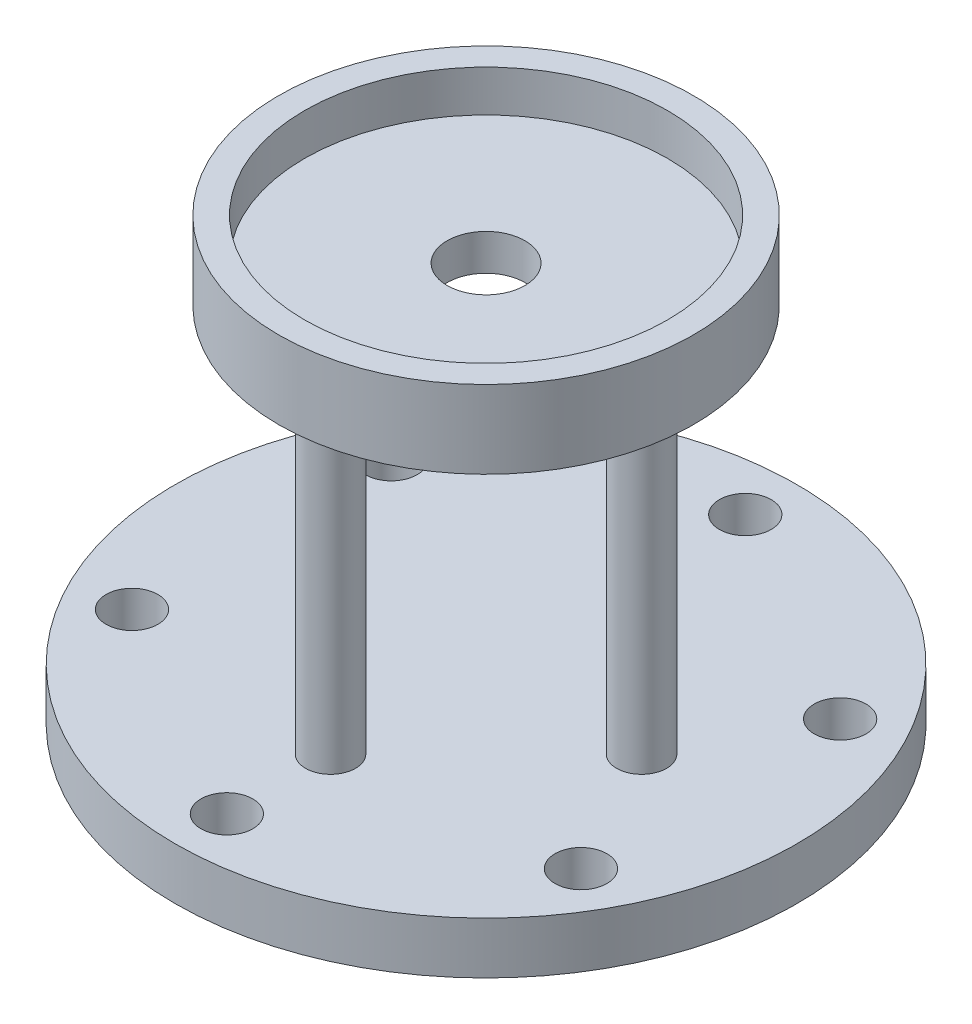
from build123d import *

# Parameters (mm, degrees)
SKETCH_1_R                            = 60
SKETCH_1_R_2                          = 5
BASE_D120_T10_6XD10_PCD100_DEPTH      = 10
FOUR_ORIGINAL_SUPPORT_POSTS_L60_START = 10
SKETCH_2_R                            = 4.818079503
FOUR_ORIGINAL_SUPPORT_POSTS_L60_DEPTH = 60
UPPER_SUPPORT_D80_THROUGH_D15_START   = 70
SKETCH_3_R                            = 40
SKETCH_3_R_2                          = 7.5
UPPER_SUPPORT_D80_THROUGH_D15_DEPTH   = 7
BEARING_CUP_D80_D70_DEPTH8_START      = 77
SKETCH_4_R                            = 40
SKETCH_4_R_2                          = 35
BEARING_CUP_D80_D70_DEPTH8_DEPTH      = 8


with BuildPart() as part:
    # Sketch 1 → Base_D120_T10_6xD10_PCD100 (new body)
    with BuildSketch(Plane(origin=(0, 0, 0), x_dir=(1, 0, 0), z_dir=(0, 1, 0))):
        with Locations(Location((0, 0, 0), (0, 0, 270))):
            Circle(SKETCH_1_R)
        with Locations(Location((0, 50, 0), (0, 0, 270))):
            Circle(SKETCH_1_R_2, mode=Mode.SUBTRACT)
        with Locations(Location((43.301270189, 25, 0), (0, 0, 270))):
            Circle(SKETCH_1_R_2, mode=Mode.SUBTRACT)
        with Locations(Location((43.301270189, -25, 0), (0, 0, 270))):
            Circle(SKETCH_1_R_2, mode=Mode.SUBTRACT)
        with Locations(Location((0, -50, 0), (0, 0, 270))):
            Circle(SKETCH_1_R_2, mode=Mode.SUBTRACT)
        with Locations(Location((-43.301270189, -25, 0), (0, 0, 270))):
            Circle(SKETCH_1_R_2, mode=Mode.SUBTRACT)
        with Locations(Location((-43.301270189, 25, 0), (0, 0, 270))):
            Circle(SKETCH_1_R_2, mode=Mode.SUBTRACT)
    extrude(amount=BASE_D120_T10_6XD10_PCD100_DEPTH)

    # Sketch 2 → Four_Original_Support_Posts_L60 (add)
    with BuildSketch(Plane(origin=(0, 0, 0), x_dir=(1, 0, 0), z_dir=(0, 1, 0)).offset(FOUR_ORIGINAL_SUPPORT_POSTS_L60_START)):
        with Locations(Location((0, -30, 0), (0, 0, 270))):
            Circle(SKETCH_2_R)
        with Locations(Location((30, 0, 0), (0, 0, 270))):
            Circle(SKETCH_2_R)
        with Locations(Location((0, 30, 0), (0, 0, 270))):
            Circle(SKETCH_2_R)
        with Locations(Location((-30, 0, 0), (0, 0, 270))):
            Circle(SKETCH_2_R)
    extrude(amount=FOUR_ORIGINAL_SUPPORT_POSTS_L60_DEPTH)

    # Sketch 3 → Upper_Support_D80_Through_D15 (add)
    with BuildSketch(Plane(origin=(0, 0, 0), x_dir=(1, 0, 0), z_dir=(0, 1, 0)).offset(UPPER_SUPPORT_D80_THROUGH_D15_START)):
        with Locations(Location((0, 0, 0), (0, 0, 270))):
            Circle(SKETCH_3_R)
        with Locations(Location((0, 0, 0), (0, 0, 270))):
            Circle(SKETCH_3_R_2, mode=Mode.SUBTRACT)
    extrude(amount=UPPER_SUPPORT_D80_THROUGH_D15_DEPTH)

    # Sketch 4 → Bearing_Cup_D80_D70_Depth8 (add)
    with BuildSketch(Plane(origin=(0, 0, 0), x_dir=(1, 0, 0), z_dir=(0, 1, 0)).offset(BEARING_CUP_D80_D70_DEPTH8_START)):
        with Locations(Location((0, 0, 0), (0, 0, 270))):
            Circle(SKETCH_4_R)
        with Locations(Location((0, 0, 0), (0, 0, 270))):
            Circle(SKETCH_4_R_2, mode=Mode.SUBTRACT)
    extrude(amount=BEARING_CUP_D80_D70_DEPTH8_DEPTH)


solid = part.part
